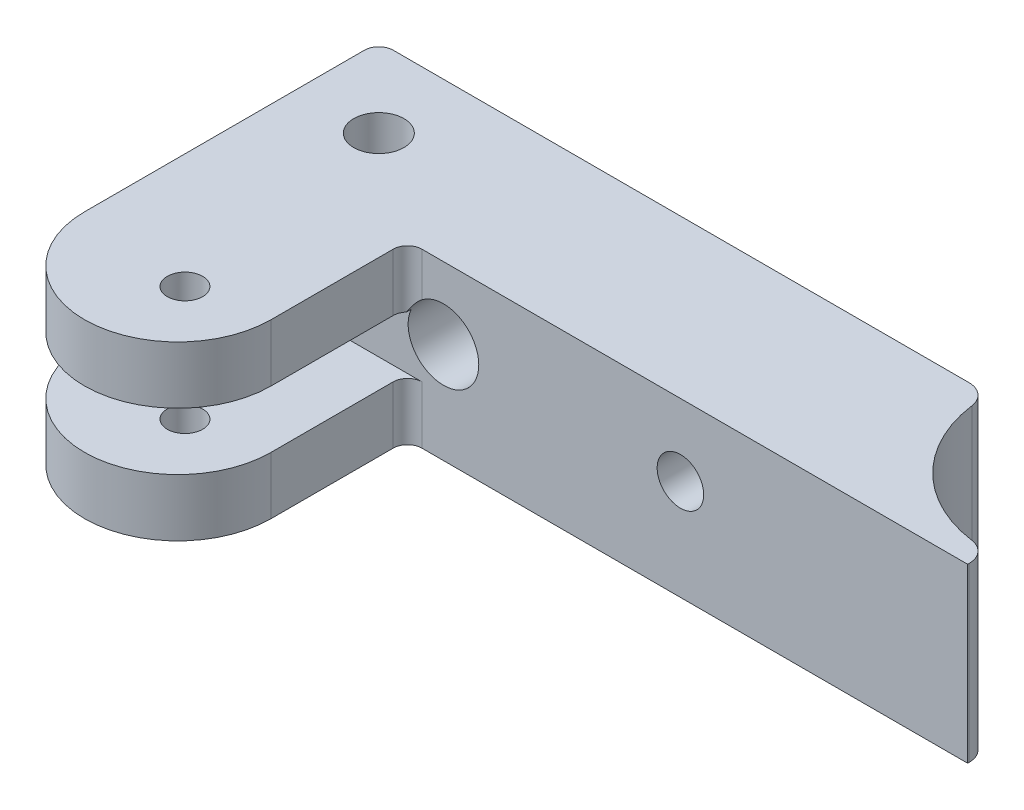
ISO-10303-21;
HEADER;
FILE_DESCRIPTION(('STEP AP214'),'2;1');
FILE_NAME('part.step','',(''),(''),'','','');
FILE_SCHEMA(('AUTOMOTIVE_DESIGN { 1 0 10303 214 1 1 1 1 }'));
ENDSEC;
DATA;
#1=APPLICATION_CONTEXT('core data for automotive mechanical design processes');
#2=APPLICATION_PROTOCOL_DEFINITION('international standard','automotive_design',2000,#1);
#3=PRODUCT_CONTEXT('',#1,'mechanical');
#4=PRODUCT('Part','Part','',(#3));
#5=PRODUCT_RELATED_PRODUCT_CATEGORY('part','',(#4));
#6=PRODUCT_DEFINITION_FORMATION('','',#4);
#7=PRODUCT_DEFINITION_CONTEXT('part definition',#1,'design');
#8=PRODUCT_DEFINITION('design','',#6,#7);
#9=PRODUCT_DEFINITION_SHAPE('','',#8);
#10=(LENGTH_UNIT() NAMED_UNIT(*) SI_UNIT(.MILLI.,.METRE.));
#11=(NAMED_UNIT(*) PLANE_ANGLE_UNIT() SI_UNIT($,.RADIAN.));
#12=(NAMED_UNIT(*) SI_UNIT($,.STERADIAN.) SOLID_ANGLE_UNIT());
#13=UNCERTAINTY_MEASURE_WITH_UNIT(LENGTH_MEASURE(1.E-05),#10,'distance_accuracy_value','');
#14=(GEOMETRIC_REPRESENTATION_CONTEXT(3) GLOBAL_UNCERTAINTY_ASSIGNED_CONTEXT((#13)) GLOBAL_UNIT_ASSIGNED_CONTEXT((#10,
#11,#12)) REPRESENTATION_CONTEXT('',''));
#15=CARTESIAN_POINT('',(0.,0.,0.));
#16=DIRECTION('',(0.,0.,1.));
#17=DIRECTION('',(1.,0.,0.));
#18=AXIS2_PLACEMENT_3D('',#15,#16,#17);
#19=CARTESIAN_POINT('',(0.,0.,27.));
#20=DIRECTION('',(0.,0.,-1.));
#21=DIRECTION('',(1.,0.,0.));
#22=AXIS2_PLACEMENT_3D('',#19,#20,#21);
#23=PLANE('',#22);
#24=CARTESIAN_POINT('',(15.5,7.,27.));
#25=DIRECTION('',(0.,0.,-1.));
#26=DIRECTION('',(1.,0.,0.));
#27=AXIS2_PLACEMENT_3D('',#24,#25,#26);
#28=CIRCLE('',#27,2.4585);
#29=CARTESIAN_POINT('',(17.9585,7.,27.));
#30=VERTEX_POINT('',#29);
#31=EDGE_CURVE('E280',#30,#30,#28,.T.);
#32=ORIENTED_EDGE('',*,*,#31,.F.);
#33=EDGE_LOOP('',(#32));
#34=FACE_BOUND('',#33,.T.);
#35=CARTESIAN_POINT('',(32.,7.,27.));
#36=DIRECTION('',(0.,0.,-1.));
#37=DIRECTION('',(1.,0.,0.));
#38=AXIS2_PLACEMENT_3D('',#35,#36,#37);
#39=CIRCLE('',#38,1.621);
#40=CARTESIAN_POINT('',(33.621,7.,27.));
#41=VERTEX_POINT('',#40);
#42=EDGE_CURVE('E282',#41,#41,#39,.T.);
#43=ORIENTED_EDGE('',*,*,#42,.F.);
#44=EDGE_LOOP('',(#43));
#45=FACE_BOUND('',#44,.T.);
#46=DIRECTION('',(0.,1.,0.));
#47=VECTOR('',#46,1.);
#48=CARTESIAN_POINT('',(1.,0.,27.));
#49=LINE('',#48,#47);
#50=CARTESIAN_POINT('',(1.,0.,27.));
#51=VERTEX_POINT('',#50);
#52=CARTESIAN_POINT('',(1.,12.,27.));
#53=VERTEX_POINT('',#52);
#54=EDGE_CURVE('E192',#51,#53,#49,.T.);
#55=ORIENTED_EDGE('',*,*,#54,.T.);
#56=DIRECTION('',(1.,0.,0.));
#57=VECTOR('',#56,1.);
#58=CARTESIAN_POINT('',(0.,12.,27.));
#59=LINE('',#58,#57);
#60=CARTESIAN_POINT('',(41.1027526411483,12.,27.));
#61=VERTEX_POINT('',#60);
#62=EDGE_CURVE('E217',#53,#61,#59,.T.);
#63=ORIENTED_EDGE('',*,*,#62,.T.);
#64=DIRECTION('',(0.,-1.,0.));
#65=VECTOR('',#64,1.);
#66=CARTESIAN_POINT('',(41.1027526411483,59.8080262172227,27.));
#67=LINE('',#66,#65);
#68=CARTESIAN_POINT('',(41.1027526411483,0.,27.));
#69=VERTEX_POINT('',#68);
#70=EDGE_CURVE('E199',#61,#69,#67,.T.);
#71=ORIENTED_EDGE('',*,*,#70,.T.);
#72=DIRECTION('',(1.,0.,0.));
#73=VECTOR('',#72,1.);
#74=CARTESIAN_POINT('',(0.,0.,27.));
#75=LINE('',#74,#73);
#76=EDGE_CURVE('E185',#51,#69,#75,.T.);
#77=ORIENTED_EDGE('',*,*,#76,.F.);
#78=EDGE_LOOP('',(#55,#63,#71,#77));
#79=FACE_BOUND('',#78,.T.);
#80=ADVANCED_FACE('F40',(#34,#45,#79),#23,.T.);
#81=CARTESIAN_POINT('',(5.5,59.8080262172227,32.5));
#82=DIRECTION('',(0.,1.,0.));
#83=DIRECTION('',(1.,0.,0.));
#84=AXIS2_PLACEMENT_3D('',#81,#82,#83);
#85=CYLINDRICAL_SURFACE('',#84,1.75);
#86=CARTESIAN_POINT('',(5.5,6.5,32.5));
#87=DIRECTION('',(0.,1.,0.));
#88=DIRECTION('',(1.,0.,0.));
#89=AXIS2_PLACEMENT_3D('',#86,#87,#88);
#90=CIRCLE('',#89,1.75);
#91=CARTESIAN_POINT('',(3.75,6.5,32.5));
#92=VERTEX_POINT('',#91);
#93=EDGE_CURVE('E11',#92,#92,#90,.T.);
#94=ORIENTED_EDGE('',*,*,#93,.F.);
#95=EDGE_LOOP('',(#94));
#96=FACE_BOUND('',#95,.T.);
#97=CARTESIAN_POINT('',(5.5,12.,32.5));
#98=DIRECTION('',(0.,1.,0.));
#99=DIRECTION('',(1.,0.,0.));
#100=AXIS2_PLACEMENT_3D('',#97,#98,#99);
#101=CIRCLE('',#100,1.75);
#102=CARTESIAN_POINT('',(3.75,12.,32.5));
#103=VERTEX_POINT('',#102);
#104=EDGE_CURVE('E327',#103,#103,#101,.T.);
#105=ORIENTED_EDGE('',*,*,#104,.T.);
#106=EDGE_LOOP('',(#105));
#107=FACE_BOUND('',#106,.T.);
#108=ADVANCED_FACE('F395',(#96,#107),#85,.F.);
#109=CARTESIAN_POINT('',(5.5,3.25,32.5));
#110=DIRECTION('',(0.,1.,0.));
#111=DIRECTION('',(1.,0.,0.));
#112=AXIS2_PLACEMENT_3D('',#109,#110,#111);
#113=CYLINDRICAL_SURFACE('',#112,4.);
#114=CARTESIAN_POINT('',(5.5,6.5,32.5));
#115=DIRECTION('',(0.,1.,0.));
#116=DIRECTION('',(1.,0.,0.));
#117=AXIS2_PLACEMENT_3D('',#114,#115,#116);
#118=CIRCLE('',#117,4.);
#119=CARTESIAN_POINT('',(9.5,6.5,32.5));
#120=VERTEX_POINT('',#119);
#121=EDGE_CURVE('E52',#120,#120,#118,.T.);
#122=ORIENTED_EDGE('',*,*,#121,.T.);
#123=EDGE_LOOP('',(#122));
#124=FACE_BOUND('',#123,.T.);
#125=CARTESIAN_POINT('',(5.5,0.,32.5));
#126=DIRECTION('',(0.,-1.,0.));
#127=DIRECTION('',(1.,0.,0.));
#128=AXIS2_PLACEMENT_3D('',#125,#126,#127);
#129=CIRCLE('',#128,4.);
#130=CARTESIAN_POINT('',(9.5,0.,32.5));
#131=VERTEX_POINT('',#130);
#132=EDGE_CURVE('E247',#131,#131,#129,.T.);
#133=ORIENTED_EDGE('',*,*,#132,.T.);
#134=EDGE_LOOP('',(#133));
#135=FACE_BOUND('',#134,.T.);
#136=ADVANCED_FACE('F387',(#124,#135),#113,.F.);
#137=CARTESIAN_POINT('',(5.5,6.5,32.5));
#138=DIRECTION('',(0.,-1.,0.));
#139=DIRECTION('',(1.,0.,0.));
#140=AXIS2_PLACEMENT_3D('',#137,#138,#139);
#141=PLANE('',#140);
#142=ORIENTED_EDGE('',*,*,#93,.T.);
#143=EDGE_LOOP('',(#142));
#144=FACE_BOUND('',#143,.T.);
#145=ORIENTED_EDGE('',*,*,#121,.F.);
#146=EDGE_LOOP('',(#145));
#147=FACE_BOUND('',#146,.T.);
#148=ADVANCED_FACE('F383',(#144,#147),#141,.T.);
#149=CARTESIAN_POINT('',(8.,-47.8080262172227,48.5));
#150=DIRECTION('',(0.,-1.,0.));
#151=DIRECTION('',(1.,0.,0.));
#152=AXIS2_PLACEMENT_3D('',#149,#150,#151);
#153=CYLINDRICAL_SURFACE('',#152,1.2295);
#154=CARTESIAN_POINT('',(8.,12.,48.5));
#155=DIRECTION('',(0.,1.,0.));
#156=DIRECTION('',(1.,0.,0.));
#157=AXIS2_PLACEMENT_3D('',#154,#155,#156);
#158=CIRCLE('',#157,1.2295);
#159=CARTESIAN_POINT('',(9.2295,12.,48.5));
#160=VERTEX_POINT('',#159);
#161=EDGE_CURVE('E323',#160,#160,#158,.T.);
#162=ORIENTED_EDGE('',*,*,#161,.T.);
#163=EDGE_LOOP('',(#162));
#164=FACE_BOUND('',#163,.T.);
#165=CARTESIAN_POINT('',(8.,8.,48.5));
#166=DIRECTION('',(0.,1.,0.));
#167=DIRECTION('',(1.,0.,0.));
#168=AXIS2_PLACEMENT_3D('',#165,#166,#167);
#169=CIRCLE('',#168,1.2295);
#170=CARTESIAN_POINT('',(6.7705,8.,48.5));
#171=VERTEX_POINT('',#170);
#172=EDGE_CURVE('E331',#171,#171,#169,.T.);
#173=ORIENTED_EDGE('',*,*,#172,.F.);
#174=EDGE_LOOP('',(#173));
#175=FACE_BOUND('',#174,.T.);
#176=ADVANCED_FACE('F379',(#164,#175),#153,.F.);
#177=CARTESIAN_POINT('',(8.,-47.8080262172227,48.5));
#178=DIRECTION('',(0.,-1.,0.));
#179=DIRECTION('',(1.,0.,0.));
#180=AXIS2_PLACEMENT_3D('',#177,#178,#179);
#181=CYLINDRICAL_SURFACE('',#180,1.2295);
#182=CARTESIAN_POINT('',(8.,4.,48.5));
#183=DIRECTION('',(0.,-1.,0.));
#184=DIRECTION('',(1.,0.,0.));
#185=AXIS2_PLACEMENT_3D('',#182,#183,#184);
#186=CIRCLE('',#185,1.2295);
#187=CARTESIAN_POINT('',(6.7705,4.,48.5));
#188=VERTEX_POINT('',#187);
#189=EDGE_CURVE('E307',#188,#188,#186,.T.);
#190=ORIENTED_EDGE('',*,*,#189,.F.);
#191=EDGE_LOOP('',(#190));
#192=FACE_BOUND('',#191,.T.);
#193=CARTESIAN_POINT('',(8.,0.,48.5));
#194=DIRECTION('',(0.,-1.,0.));
#195=DIRECTION('',(1.,0.,0.));
#196=AXIS2_PLACEMENT_3D('',#193,#194,#195);
#197=CIRCLE('',#196,1.2295);
#198=CARTESIAN_POINT('',(6.7705,0.,48.5));
#199=VERTEX_POINT('',#198);
#200=EDGE_CURVE('E201',#199,#199,#197,.T.);
#201=ORIENTED_EDGE('',*,*,#200,.T.);
#202=EDGE_LOOP('',(#201));
#203=FACE_BOUND('',#202,.T.);
#204=ADVANCED_FACE('F382',(#192,#203),#181,.F.);
#205=CARTESIAN_POINT('',(15.5,7.,86.8080262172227));
#206=DIRECTION('',(0.,0.,1.));
#207=DIRECTION('',(1.,0.,0.));
#208=AXIS2_PLACEMENT_3D('',#205,#206,#207);
#209=CYLINDRICAL_SURFACE('',#208,2.4585);
#210=ORIENTED_EDGE('',*,*,#31,.T.);
#211=EDGE_LOOP('',(#210));
#212=FACE_BOUND('',#211,.T.);
#213=CARTESIAN_POINT('',(15.5,7.,38.));
#214=DIRECTION('',(0.,0.,1.));
#215=DIRECTION('',(1.,0.,0.));
#216=AXIS2_PLACEMENT_3D('',#213,#214,#215);
#217=CIRCLE('',#216,2.4585);
#218=CARTESIAN_POINT('',(13.2540653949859,8.,38.));
#219=VERTEX_POINT('',#218);
#220=CARTESIAN_POINT('',(14.,8.94787634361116,38.));
#221=VERTEX_POINT('',#220);
#222=EDGE_CURVE('E234',#219,#221,#217,.T.);
#223=ORIENTED_EDGE('',*,*,#222,.T.);
#224=CARTESIAN_POINT('',(14.0000001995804,8.94787649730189,37.9993376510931));
#225=CARTESIAN_POINT('',(13.9810851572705,8.93331175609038,37.9993298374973));
#226=CARTESIAN_POINT('',(13.9623864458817,8.91847249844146,37.9998743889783));
#227=CARTESIAN_POINT('',(13.924939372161,8.88785760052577,38.0020133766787));
#228=CARTESIAN_POINT('',(13.9062046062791,8.87206734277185,38.0036371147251));
#229=CARTESIAN_POINT('',(13.8687383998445,8.83952219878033,38.0079331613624));
#230=CARTESIAN_POINT('',(13.8500231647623,8.82275260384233,38.01063482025));
#231=CARTESIAN_POINT('',(13.8126489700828,8.78822126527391,38.0170869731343));
#232=CARTESIAN_POINT('',(13.7940086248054,8.77044485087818,38.020866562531));
#233=CARTESIAN_POINT('',(13.7568413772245,8.73387447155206,38.0294751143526));
#234=CARTESIAN_POINT('',(13.738335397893,8.71506601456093,38.0343326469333));
#235=CARTESIAN_POINT('',(13.7014968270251,8.67640786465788,38.0450967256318));
#236=CARTESIAN_POINT('',(13.6831873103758,8.65654396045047,38.0510310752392));
#237=CARTESIAN_POINT('',(13.6468059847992,8.61575500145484,38.0639534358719));
#238=CARTESIAN_POINT('',(13.6287592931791,8.59481615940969,38.0709684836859));
#239=CARTESIAN_POINT('',(13.5929672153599,8.55185496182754,38.0860380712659));
#240=CARTESIAN_POINT('',(13.5752487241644,8.5298191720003,38.094118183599));
#241=CARTESIAN_POINT('',(13.5447664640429,8.49055333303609,38.1091271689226));
#242=CARTESIAN_POINT('',(13.5318127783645,8.47340416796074,38.1158835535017));
#243=CARTESIAN_POINT('',(13.5058082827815,8.43802903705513,38.1302066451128));
#244=CARTESIAN_POINT('',(13.492785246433,8.41979223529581,38.1377970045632));
#245=CARTESIAN_POINT('',(13.4667099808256,8.38220907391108,38.1537782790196));
#246=CARTESIAN_POINT('',(13.4536866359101,8.36285162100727,38.1621901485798));
#247=CARTESIAN_POINT('',(13.4276858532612,8.32299975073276,38.1798198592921));
#248=CARTESIAN_POINT('',(13.4147385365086,8.3024942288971,38.1890569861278));
#249=CARTESIAN_POINT('',(13.388968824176,8.2603202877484,38.2083379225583));
#250=CARTESIAN_POINT('',(13.3761777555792,8.23864079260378,38.2183993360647));
#251=CARTESIAN_POINT('',(13.3508044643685,8.19409618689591,38.2393307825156));
#252=CARTESIAN_POINT('',(13.338254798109,8.17122014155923,38.2502169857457));
#253=CARTESIAN_POINT('',(13.3134527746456,8.12426306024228,38.272798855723));
#254=CARTESIAN_POINT('',(13.3012342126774,8.10017133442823,38.2845093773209));
#255=CARTESIAN_POINT('',(13.2771878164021,8.0507676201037,38.3087428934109));
#256=CARTESIAN_POINT('',(13.2653950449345,8.02544530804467,38.3212796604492));
#257=CARTESIAN_POINT('',(13.2540643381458,7.99999762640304,38.3339751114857));
#258=B_SPLINE_CURVE_WITH_KNOTS('',3,(#224,#225,#226,#227,#228,#229,#230,#231,#232,#233,#234,
#235,#236,#237,#238,#239,#240,#241,#242,#243,#244,#245,#246,#247,#248,#249,#250,#251,#252,#253,
#254,#255,#256,#257),.UNSPECIFIED.,.F.,.F.,(4,2,2,2,2,2,2,2,2,2,2,2,2,2,2,2,4),(0.,
0.0716035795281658,0.145235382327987,0.221026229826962,0.299096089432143,0.379554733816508,
0.46250245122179,0.54803077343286,0.636223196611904,0.703797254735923,0.774763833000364,
0.849153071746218,0.92699113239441,1.00830084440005,1.0931022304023,1.18141293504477,
1.27324857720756),.UNSPECIFIED.);
#259=CARTESIAN_POINT('',(13.2540653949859,8.,38.3339808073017));
#260=VERTEX_POINT('',#259);
#261=EDGE_CURVE('E348',#221,#260,#258,.T.);
#262=ORIENTED_EDGE('',*,*,#261,.T.);
#263=DIRECTION('',(0.,0.,-1.));
#264=VECTOR('',#263,1.);
#265=CARTESIAN_POINT('',(13.2540653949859,8.,86.8080262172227));
#266=LINE('',#265,#264);
#267=EDGE_CURVE('E270',#260,#219,#266,.T.);
#268=ORIENTED_EDGE('',*,*,#267,.T.);
#269=EDGE_LOOP('',(#223,#262,#268));
#270=FACE_BOUND('',#269,.T.);
#271=ADVANCED_FACE('F402',(#212,#270),#209,.F.);
#272=CARTESIAN_POINT('',(32.,7.,86.8080262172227));
#273=DIRECTION('',(0.,0.,1.));
#274=DIRECTION('',(1.,0.,0.));
#275=AXIS2_PLACEMENT_3D('',#272,#273,#274);
#276=CYLINDRICAL_SURFACE('',#275,1.621);
#277=ORIENTED_EDGE('',*,*,#42,.T.);
#278=EDGE_LOOP('',(#277));
#279=FACE_BOUND('',#278,.T.);
#280=CARTESIAN_POINT('',(32.,7.,38.));
#281=DIRECTION('',(0.,0.,1.));
#282=DIRECTION('',(1.,0.,0.));
#283=AXIS2_PLACEMENT_3D('',#280,#281,#282);
#284=CIRCLE('',#283,1.621);
#285=CARTESIAN_POINT('',(30.379,7.,38.));
#286=VERTEX_POINT('',#285);
#287=EDGE_CURVE('E231',#286,#286,#284,.T.);
#288=ORIENTED_EDGE('',*,*,#287,.T.);
#289=EDGE_LOOP('',(#288));
#290=FACE_BOUND('',#289,.T.);
#291=ADVANCED_FACE('F407',(#279,#290),#276,.F.);
#292=CARTESIAN_POINT('',(52.,0.,27.));
#293=DIRECTION('',(1.,0.,0.));
#294=DIRECTION('',(0.,0.,1.));
#295=AXIS2_PLACEMENT_3D('',#292,#293,#294);
#296=PLANE('',#295);
#297=DIRECTION('',(0.,1.,0.));
#298=VECTOR('',#297,1.);
#299=CARTESIAN_POINT('',(52.,59.8080262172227,37.8972473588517));
#300=LINE('',#299,#298);
#301=CARTESIAN_POINT('',(52.,0.,37.8972473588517));
#302=VERTEX_POINT('',#301);
#303=CARTESIAN_POINT('',(52.,12.,37.8972473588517));
#304=VERTEX_POINT('',#303);
#305=EDGE_CURVE('E224',#302,#304,#300,.T.);
#306=ORIENTED_EDGE('',*,*,#305,.T.);
#307=DIRECTION('',(0.,0.,1.));
#308=VECTOR('',#307,1.);
#309=CARTESIAN_POINT('',(52.,12.,27.));
#310=LINE('',#309,#308);
#311=CARTESIAN_POINT('',(52.,12.,38.));
#312=VERTEX_POINT('',#311);
#313=EDGE_CURVE('E279',#304,#312,#310,.T.);
#314=ORIENTED_EDGE('',*,*,#313,.T.);
#315=DIRECTION('',(0.,1.,0.));
#316=VECTOR('',#315,1.);
#317=CARTESIAN_POINT('',(52.,0.,38.));
#318=LINE('',#317,#316);
#319=CARTESIAN_POINT('',(52.,0.,38.));
#320=VERTEX_POINT('',#319);
#321=EDGE_CURVE('E296',#320,#312,#318,.T.);
#322=ORIENTED_EDGE('',*,*,#321,.F.);
#323=DIRECTION('',(0.,0.,1.));
#324=VECTOR('',#323,1.);
#325=CARTESIAN_POINT('',(52.,0.,27.));
#326=LINE('',#325,#324);
#327=EDGE_CURVE('E239',#302,#320,#326,.T.);
#328=ORIENTED_EDGE('',*,*,#327,.F.);
#329=EDGE_LOOP('',(#306,#314,#322,#328));
#330=FACE_BOUND('',#329,.T.);
#331=ADVANCED_FACE('F437',(#330),#296,.T.);
#332=CARTESIAN_POINT('',(41.1027526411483,59.8080262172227,28.5));
#333=DIRECTION('',(0.,-1.,0.));
#334=DIRECTION('',(0.657128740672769,0.,-0.753778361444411));
#335=AXIS2_PLACEMENT_3D('',#332,#333,#334);
#336=CYLINDRICAL_SURFACE('',#335,1.5);
#337=CARTESIAN_POINT('',(41.1027526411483,12.,28.5));
#338=DIRECTION('',(0.,1.,0.));
#339=DIRECTION('',(0.657128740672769,0.,-0.753778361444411));
#340=AXIS2_PLACEMENT_3D('',#337,#338,#339);
#341=CIRCLE('',#340,1.5);
#342=CARTESIAN_POINT('',(42.5887409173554,12.,28.2954545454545));
#343=VERTEX_POINT('',#342);
#344=EDGE_CURVE('E248',#343,#61,#341,.T.);
#345=ORIENTED_EDGE('',*,*,#344,.F.);
#346=DIRECTION('',(0.,1.,0.));
#347=VECTOR('',#346,1.);
#348=CARTESIAN_POINT('',(42.5887409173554,59.8080262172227,28.2954545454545));
#349=LINE('',#348,#347);
#350=CARTESIAN_POINT('',(42.5887409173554,0.,28.2954545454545));
#351=VERTEX_POINT('',#350);
#352=EDGE_CURVE('E223',#351,#343,#349,.T.);
#353=ORIENTED_EDGE('',*,*,#352,.F.);
#354=CARTESIAN_POINT('',(41.1027526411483,0.,28.5));
#355=DIRECTION('',(0.,-1.,0.));
#356=DIRECTION('',(0.657128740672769,0.,-0.753778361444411));
#357=AXIS2_PLACEMENT_3D('',#354,#355,#356);
#358=CIRCLE('',#357,1.5);
#359=EDGE_CURVE('E202',#69,#351,#358,.T.);
#360=ORIENTED_EDGE('',*,*,#359,.F.);
#361=ORIENTED_EDGE('',*,*,#70,.F.);
#362=EDGE_LOOP('',(#345,#353,#360,#361));
#363=FACE_BOUND('',#362,.T.);
#364=ADVANCED_FACE('F440',(#363),#336,.T.);
#365=CARTESIAN_POINT('',(52.,59.8080262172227,27.));
#366=DIRECTION('',(0.,1.,0.));
#367=DIRECTION('',(1.,0.,0.));
#368=AXIS2_PLACEMENT_3D('',#365,#366,#367);
#369=CYLINDRICAL_SURFACE('',#368,9.5);
#370=DIRECTION('',(0.,-1.,0.));
#371=VECTOR('',#370,1.);
#372=CARTESIAN_POINT('',(50.7045454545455,59.8080262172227,36.4112590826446));
#373=LINE('',#372,#371);
#374=CARTESIAN_POINT('',(50.7045454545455,12.,36.4112590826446));
#375=VERTEX_POINT('',#374);
#376=CARTESIAN_POINT('',(50.7045454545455,0.,36.4112590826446));
#377=VERTEX_POINT('',#376);
#378=EDGE_CURVE('E219',#375,#377,#373,.T.);
#379=ORIENTED_EDGE('',*,*,#378,.T.);
#380=CARTESIAN_POINT('',(52.,0.,27.));
#381=DIRECTION('',(0.,-1.,0.));
#382=DIRECTION('',(1.,0.,0.));
#383=AXIS2_PLACEMENT_3D('',#380,#381,#382);
#384=CIRCLE('',#383,9.5);
#385=EDGE_CURVE('E238',#377,#351,#384,.T.);
#386=ORIENTED_EDGE('',*,*,#385,.T.);
#387=ORIENTED_EDGE('',*,*,#352,.T.);
#388=CARTESIAN_POINT('',(52.,12.,27.));
#389=DIRECTION('',(0.,1.,0.));
#390=DIRECTION('',(1.,0.,0.));
#391=AXIS2_PLACEMENT_3D('',#388,#389,#390);
#392=CIRCLE('',#391,9.5);
#393=EDGE_CURVE('E251',#343,#375,#392,.T.);
#394=ORIENTED_EDGE('',*,*,#393,.T.);
#395=EDGE_LOOP('',(#379,#386,#387,#394));
#396=FACE_BOUND('',#395,.T.);
#397=ADVANCED_FACE('F42',(#396),#369,.F.);
#398=CARTESIAN_POINT('',(50.5,59.8080262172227,37.8972473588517));
#399=DIRECTION('',(0.,1.,0.));
#400=DIRECTION('',(0.753778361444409,0.,-0.657128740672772));
#401=AXIS2_PLACEMENT_3D('',#398,#399,#400);
#402=CYLINDRICAL_SURFACE('',#401,1.5);
#403=CARTESIAN_POINT('',(50.5,0.,37.8972473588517));
#404=DIRECTION('',(0.,-1.,0.));
#405=DIRECTION('',(0.753778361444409,0.,-0.657128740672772));
#406=AXIS2_PLACEMENT_3D('',#403,#404,#405);
#407=CIRCLE('',#406,1.5);
#408=EDGE_CURVE('E235',#377,#302,#407,.T.);
#409=ORIENTED_EDGE('',*,*,#408,.F.);
#410=ORIENTED_EDGE('',*,*,#378,.F.);
#411=CARTESIAN_POINT('',(50.5,12.,37.8972473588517));
#412=DIRECTION('',(0.,1.,0.));
#413=DIRECTION('',(0.753778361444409,0.,-0.657128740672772));
#414=AXIS2_PLACEMENT_3D('',#411,#412,#413);
#415=CIRCLE('',#414,1.5);
#416=EDGE_CURVE('E144',#304,#375,#415,.T.);
#417=ORIENTED_EDGE('',*,*,#416,.F.);
#418=ORIENTED_EDGE('',*,*,#305,.F.);
#419=EDGE_LOOP('',(#409,#410,#417,#418));
#420=FACE_BOUND('',#419,.T.);
#421=ADVANCED_FACE('F429',(#420),#402,.T.);
#422=CARTESIAN_POINT('',(13.,4.,54.));
#423=DIRECTION('',(0.,-1.,0.));
#424=DIRECTION('',(0.,0.,-1.));
#425=AXIS2_PLACEMENT_3D('',#422,#423,#424);
#426=PLANE('',#425);
#427=ORIENTED_EDGE('',*,*,#189,.T.);
#428=EDGE_LOOP('',(#427));
#429=FACE_BOUND('',#428,.T.);
#430=CARTESIAN_POINT('',(6.5,4.,47.5));
#431=DIRECTION('',(0.,1.,0.));
#432=DIRECTION('',(0.707106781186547,0.,0.707106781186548));
#433=AXIS2_PLACEMENT_3D('',#430,#431,#432);
#434=CIRCLE('',#433,6.5);
#435=CARTESIAN_POINT('',(0.,4.,47.5));
#436=VERTEX_POINT('',#435);
#437=CARTESIAN_POINT('',(13.,4.,47.5));
#438=VERTEX_POINT('',#437);
#439=EDGE_CURVE('E316',#436,#438,#434,.T.);
#440=ORIENTED_EDGE('',*,*,#439,.T.);
#441=DIRECTION('',(0.,0.,-1.));
#442=VECTOR('',#441,1.);
#443=CARTESIAN_POINT('',(13.,4.,46.));
#444=LINE('',#443,#442);
#445=CARTESIAN_POINT('',(13.,4.,39.));
#446=VERTEX_POINT('',#445);
#447=EDGE_CURVE('E315',#438,#446,#444,.T.);
#448=ORIENTED_EDGE('',*,*,#447,.T.);
#449=CARTESIAN_POINT('',(14.,4.,39.));
#450=DIRECTION('',(0.,-1.,0.));
#451=DIRECTION('',(-0.707106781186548,0.,-0.707106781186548));
#452=AXIS2_PLACEMENT_3D('',#449,#450,#451);
#453=CIRCLE('',#452,1.);
#454=CARTESIAN_POINT('',(14.,4.,38.));
#455=VERTEX_POINT('',#454);
#456=EDGE_CURVE('E229',#446,#455,#453,.T.);
#457=ORIENTED_EDGE('',*,*,#456,.T.);
#458=DIRECTION('',(-1.,0.,0.));
#459=VECTOR('',#458,1.);
#460=CARTESIAN_POINT('',(13.,4.,38.));
#461=LINE('',#460,#459);
#462=CARTESIAN_POINT('',(0.,4.,38.));
#463=VERTEX_POINT('',#462);
#464=EDGE_CURVE('E260',#455,#463,#461,.T.);
#465=ORIENTED_EDGE('',*,*,#464,.T.);
#466=DIRECTION('',(0.,0.,1.));
#467=VECTOR('',#466,1.);
#468=CARTESIAN_POINT('',(0.,4.,54.));
#469=LINE('',#468,#467);
#470=EDGE_CURVE('E252',#463,#436,#469,.T.);
#471=ORIENTED_EDGE('',*,*,#470,.T.);
#472=EDGE_LOOP('',(#440,#448,#457,#465,#471));
#473=FACE_BOUND('',#472,.T.);
#474=ADVANCED_FACE('F432',(#429,#473),#426,.F.);
#475=CARTESIAN_POINT('',(13.,0.,38.));
#476=DIRECTION('',(1.,0.,0.));
#477=DIRECTION('',(0.,0.,1.));
#478=AXIS2_PLACEMENT_3D('',#475,#476,#477);
#479=PLANE('',#478);
#480=DIRECTION('',(0.,1.,0.));
#481=VECTOR('',#480,1.);
#482=CARTESIAN_POINT('',(13.,0.,39.));
#483=LINE('',#482,#481);
#484=CARTESIAN_POINT('',(13.,0.,39.));
#485=VERTEX_POINT('',#484);
#486=EDGE_CURVE('E515',#485,#446,#483,.T.);
#487=ORIENTED_EDGE('',*,*,#486,.T.);
#488=ORIENTED_EDGE('',*,*,#447,.F.);
#489=DIRECTION('',(0.,-1.,0.));
#490=VECTOR('',#489,1.);
#491=CARTESIAN_POINT('',(13.,0.,47.5));
#492=LINE('',#491,#490);
#493=CARTESIAN_POINT('',(13.,0.,47.5));
#494=VERTEX_POINT('',#493);
#495=EDGE_CURVE('E311',#438,#494,#492,.T.);
#496=ORIENTED_EDGE('',*,*,#495,.T.);
#497=DIRECTION('',(0.,0.,1.));
#498=VECTOR('',#497,1.);
#499=CARTESIAN_POINT('',(13.,0.,38.));
#500=LINE('',#499,#498);
#501=EDGE_CURVE('E242',#485,#494,#500,.T.);
#502=ORIENTED_EDGE('',*,*,#501,.F.);
#503=EDGE_LOOP('',(#487,#488,#496,#502));
#504=FACE_BOUND('',#503,.T.);
#505=ADVANCED_FACE('F433',(#504),#479,.T.);
#506=CARTESIAN_POINT('',(6.5,0.,47.5));
#507=DIRECTION('',(0.,-1.,0.));
#508=DIRECTION('',(0.707106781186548,0.,0.707106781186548));
#509=AXIS2_PLACEMENT_3D('',#506,#507,#508);
#510=CYLINDRICAL_SURFACE('',#509,6.5);
#511=ORIENTED_EDGE('',*,*,#439,.F.);
#512=DIRECTION('',(0.,1.,0.));
#513=VECTOR('',#512,1.);
#514=CARTESIAN_POINT('',(0.,0.,47.5));
#515=LINE('',#514,#513);
#516=CARTESIAN_POINT('',(0.,0.,47.5));
#517=VERTEX_POINT('',#516);
#518=EDGE_CURVE('E256',#517,#436,#515,.T.);
#519=ORIENTED_EDGE('',*,*,#518,.F.);
#520=CARTESIAN_POINT('',(6.5,0.,47.5));
#521=DIRECTION('',(0.,-1.,0.));
#522=DIRECTION('',(-0.707106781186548,0.,0.707106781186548));
#523=AXIS2_PLACEMENT_3D('',#520,#521,#522);
#524=CIRCLE('',#523,6.5);
#525=EDGE_CURVE('E152',#494,#517,#524,.T.);
#526=ORIENTED_EDGE('',*,*,#525,.F.);
#527=ORIENTED_EDGE('',*,*,#495,.F.);
#528=EDGE_LOOP('',(#511,#519,#526,#527));
#529=FACE_BOUND('',#528,.T.);
#530=ADVANCED_FACE('F377',(#529),#510,.T.);
#531=CARTESIAN_POINT('',(6.5,0.,47.5));
#532=DIRECTION('',(0.,-1.,0.));
#533=DIRECTION('',(0.707106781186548,0.,0.707106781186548));
#534=AXIS2_PLACEMENT_3D('',#531,#532,#533);
#535=CYLINDRICAL_SURFACE('',#534,6.5);
#536=CARTESIAN_POINT('',(6.5,12.,47.5));
#537=DIRECTION('',(0.,1.,0.));
#538=DIRECTION('',(-0.707106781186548,0.,0.707106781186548));
#539=AXIS2_PLACEMENT_3D('',#536,#537,#538);
#540=CIRCLE('',#539,6.5);
#541=CARTESIAN_POINT('',(0.,12.,47.5));
#542=VERTEX_POINT('',#541);
#543=CARTESIAN_POINT('',(13.,12.,47.5));
#544=VERTEX_POINT('',#543);
#545=EDGE_CURVE('E243',#542,#544,#540,.T.);
#546=ORIENTED_EDGE('',*,*,#545,.F.);
#547=DIRECTION('',(0.,1.,0.));
#548=VECTOR('',#547,1.);
#549=CARTESIAN_POINT('',(0.,0.,47.5));
#550=LINE('',#549,#548);
#551=CARTESIAN_POINT('',(0.,8.,47.5));
#552=VERTEX_POINT('',#551);
#553=EDGE_CURVE('E213',#552,#542,#550,.T.);
#554=ORIENTED_EDGE('',*,*,#553,.F.);
#555=CARTESIAN_POINT('',(6.5,8.,47.5));
#556=DIRECTION('',(0.,-1.,0.));
#557=DIRECTION('',(-0.707106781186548,0.,0.707106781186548));
#558=AXIS2_PLACEMENT_3D('',#555,#556,#557);
#559=CIRCLE('',#558,6.5);
#560=CARTESIAN_POINT('',(13.,8.,47.5));
#561=VERTEX_POINT('',#560);
#562=EDGE_CURVE('E266',#561,#552,#559,.T.);
#563=ORIENTED_EDGE('',*,*,#562,.F.);
#564=DIRECTION('',(0.,-1.,0.));
#565=VECTOR('',#564,1.);
#566=CARTESIAN_POINT('',(13.,0.,47.5));
#567=LINE('',#566,#565);
#568=EDGE_CURVE('E230',#544,#561,#567,.T.);
#569=ORIENTED_EDGE('',*,*,#568,.F.);
#570=EDGE_LOOP('',(#546,#554,#563,#569));
#571=FACE_BOUND('',#570,.T.);
#572=ADVANCED_FACE('F373',(#571),#535,.T.);
#573=CARTESIAN_POINT('',(13.,8.,38.));
#574=DIRECTION('',(0.,1.,0.));
#575=DIRECTION('',(0.,0.,1.));
#576=AXIS2_PLACEMENT_3D('',#573,#574,#575);
#577=PLANE('',#576);
#578=ORIENTED_EDGE('',*,*,#172,.T.);
#579=EDGE_LOOP('',(#578));
#580=FACE_BOUND('',#579,.T.);
#581=ORIENTED_EDGE('',*,*,#562,.T.);
#582=DIRECTION('',(0.,0.,-1.));
#583=VECTOR('',#582,1.);
#584=CARTESIAN_POINT('',(0.,8.,46.));
#585=LINE('',#584,#583);
#586=CARTESIAN_POINT('',(0.,8.,38.));
#587=VERTEX_POINT('',#586);
#588=EDGE_CURVE('E257',#552,#587,#585,.T.);
#589=ORIENTED_EDGE('',*,*,#588,.T.);
#590=DIRECTION('',(1.,0.,0.));
#591=VECTOR('',#590,1.);
#592=CARTESIAN_POINT('',(32.5,8.,38.));
#593=LINE('',#592,#591);
#594=EDGE_CURVE('E310',#587,#219,#593,.T.);
#595=ORIENTED_EDGE('',*,*,#594,.T.);
#596=ORIENTED_EDGE('',*,*,#267,.F.);
#597=CARTESIAN_POINT('',(14.,8.,39.));
#598=DIRECTION('',(0.,-1.,0.));
#599=DIRECTION('',(-0.707106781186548,0.,-0.707106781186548));
#600=AXIS2_PLACEMENT_3D('',#597,#598,#599);
#601=CIRCLE('',#600,1.);
#602=CARTESIAN_POINT('',(13.,8.,39.));
#603=VERTEX_POINT('',#602);
#604=EDGE_CURVE('E334',#603,#260,#601,.T.);
#605=ORIENTED_EDGE('',*,*,#604,.F.);
#606=DIRECTION('',(0.,0.,1.));
#607=VECTOR('',#606,1.);
#608=CARTESIAN_POINT('',(13.,8.,38.));
#609=LINE('',#608,#607);
#610=EDGE_CURVE('E303',#603,#561,#609,.T.);
#611=ORIENTED_EDGE('',*,*,#610,.T.);
#612=EDGE_LOOP('',(#581,#589,#595,#596,#605,#611));
#613=FACE_BOUND('',#612,.T.);
#614=ADVANCED_FACE('F376',(#580,#613),#577,.F.);
#615=CARTESIAN_POINT('',(22.0506329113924,0.,36.5506329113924));
#616=DIRECTION('',(0.,1.,0.));
#617=DIRECTION('',(0.,0.,-1.));
#618=AXIS2_PLACEMENT_3D('',#615,#616,#617);
#619=PLANE('',#618);
#620=ORIENTED_EDGE('',*,*,#132,.F.);
#621=EDGE_LOOP('',(#620));
#622=FACE_BOUND('',#621,.T.);
#623=ORIENTED_EDGE('',*,*,#200,.F.);
#624=EDGE_LOOP('',(#623));
#625=FACE_BOUND('',#624,.T.);
#626=CARTESIAN_POINT('',(1.,0.,28.));
#627=DIRECTION('',(0.,-1.,0.));
#628=DIRECTION('',(-0.707106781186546,0.,-0.70710678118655));
#629=AXIS2_PLACEMENT_3D('',#626,#627,#628);
#630=CIRCLE('',#629,1.);
#631=CARTESIAN_POINT('',(0.,0.,28.));
#632=VERTEX_POINT('',#631);
#633=EDGE_CURVE('E181',#632,#51,#630,.T.);
#634=ORIENTED_EDGE('',*,*,#633,.T.);
#635=ORIENTED_EDGE('',*,*,#76,.T.);
#636=ORIENTED_EDGE('',*,*,#359,.T.);
#637=ORIENTED_EDGE('',*,*,#385,.F.);
#638=ORIENTED_EDGE('',*,*,#408,.T.);
#639=ORIENTED_EDGE('',*,*,#327,.T.);
#640=DIRECTION('',(-1.,0.,0.));
#641=VECTOR('',#640,1.);
#642=CARTESIAN_POINT('',(52.,0.,38.));
#643=LINE('',#642,#641);
#644=CARTESIAN_POINT('',(14.,0.,38.));
#645=VERTEX_POINT('',#644);
#646=EDGE_CURVE('E265',#320,#645,#643,.T.);
#647=ORIENTED_EDGE('',*,*,#646,.T.);
#648=CARTESIAN_POINT('',(14.,0.,39.));
#649=DIRECTION('',(0.,1.,0.));
#650=DIRECTION('',(-0.707106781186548,0.,-0.707106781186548));
#651=AXIS2_PLACEMENT_3D('',#648,#649,#650);
#652=CIRCLE('',#651,1.);
#653=EDGE_CURVE('E320',#645,#485,#652,.T.);
#654=ORIENTED_EDGE('',*,*,#653,.T.);
#655=ORIENTED_EDGE('',*,*,#501,.T.);
#656=ORIENTED_EDGE('',*,*,#525,.T.);
#657=DIRECTION('',(0.,0.,-1.));
#658=VECTOR('',#657,1.);
#659=CARTESIAN_POINT('',(0.,0.,54.));
#660=LINE('',#659,#658);
#661=EDGE_CURVE('E188',#517,#632,#660,.T.);
#662=ORIENTED_EDGE('',*,*,#661,.T.);
#663=EDGE_LOOP('',(#634,#635,#636,#637,#638,#639,#647,#654,#655,#656,#662));
#664=FACE_BOUND('',#663,.T.);
#665=ADVANCED_FACE('F183',(#622,#625,#664),#619,.F.);
#666=CARTESIAN_POINT('',(22.0506329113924,12.,36.5506329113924));
#667=DIRECTION('',(0.,1.,0.));
#668=DIRECTION('',(0.,0.,-1.));
#669=AXIS2_PLACEMENT_3D('',#666,#667,#668);
#670=PLANE('',#669);
#671=CARTESIAN_POINT('',(1.,12.,28.));
#672=DIRECTION('',(0.,1.,0.));
#673=DIRECTION('',(-0.707106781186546,0.,-0.70710678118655));
#674=AXIS2_PLACEMENT_3D('',#671,#672,#673);
#675=CIRCLE('',#674,1.);
#676=CARTESIAN_POINT('',(0.,12.,28.));
#677=VERTEX_POINT('',#676);
#678=EDGE_CURVE('E206',#53,#677,#675,.T.);
#679=ORIENTED_EDGE('',*,*,#678,.T.);
#680=DIRECTION('',(0.,0.,-1.));
#681=VECTOR('',#680,1.);
#682=CARTESIAN_POINT('',(0.,12.,54.));
#683=LINE('',#682,#681);
#684=EDGE_CURVE('E209',#542,#677,#683,.T.);
#685=ORIENTED_EDGE('',*,*,#684,.F.);
#686=ORIENTED_EDGE('',*,*,#545,.T.);
#687=DIRECTION('',(0.,0.,1.));
#688=VECTOR('',#687,1.);
#689=CARTESIAN_POINT('',(13.,12.,38.));
#690=LINE('',#689,#688);
#691=CARTESIAN_POINT('',(13.,12.,39.));
#692=VERTEX_POINT('',#691);
#693=EDGE_CURVE('E225',#692,#544,#690,.T.);
#694=ORIENTED_EDGE('',*,*,#693,.F.);
#695=CARTESIAN_POINT('',(14.,12.,39.));
#696=DIRECTION('',(0.,-1.,0.));
#697=DIRECTION('',(-0.707106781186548,0.,-0.707106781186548));
#698=AXIS2_PLACEMENT_3D('',#695,#696,#697);
#699=CIRCLE('',#698,1.);
#700=CARTESIAN_POINT('',(14.,12.,38.));
#701=VERTEX_POINT('',#700);
#702=EDGE_CURVE('E349',#692,#701,#699,.T.);
#703=ORIENTED_EDGE('',*,*,#702,.T.);
#704=DIRECTION('',(-1.,0.,0.));
#705=VECTOR('',#704,1.);
#706=CARTESIAN_POINT('',(52.,12.,38.));
#707=LINE('',#706,#705);
#708=EDGE_CURVE('E460',#312,#701,#707,.T.);
#709=ORIENTED_EDGE('',*,*,#708,.F.);
#710=ORIENTED_EDGE('',*,*,#313,.F.);
#711=ORIENTED_EDGE('',*,*,#416,.T.);
#712=ORIENTED_EDGE('',*,*,#393,.F.);
#713=ORIENTED_EDGE('',*,*,#344,.T.);
#714=ORIENTED_EDGE('',*,*,#62,.F.);
#715=EDGE_LOOP('',(#679,#685,#686,#694,#703,#709,#710,#711,#712,#713,#714));
#716=FACE_BOUND('',#715,.T.);
#717=ORIENTED_EDGE('',*,*,#161,.F.);
#718=EDGE_LOOP('',(#717));
#719=FACE_BOUND('',#718,.T.);
#720=ORIENTED_EDGE('',*,*,#104,.F.);
#721=EDGE_LOOP('',(#720));
#722=FACE_BOUND('',#721,.T.);
#723=ADVANCED_FACE('F391',(#716,#719,#722),#670,.T.);
#724=CARTESIAN_POINT('',(0.,0.,54.));
#725=DIRECTION('',(-1.,0.,0.));
#726=DIRECTION('',(0.,0.,-1.));
#727=AXIS2_PLACEMENT_3D('',#724,#725,#726);
#728=PLANE('',#727);
#729=DIRECTION('',(0.,-1.,0.));
#730=VECTOR('',#729,1.);
#731=CARTESIAN_POINT('',(0.,0.,28.));
#732=LINE('',#731,#730);
#733=EDGE_CURVE('E193',#677,#632,#732,.T.);
#734=ORIENTED_EDGE('',*,*,#733,.T.);
#735=ORIENTED_EDGE('',*,*,#661,.F.);
#736=ORIENTED_EDGE('',*,*,#518,.T.);
#737=ORIENTED_EDGE('',*,*,#470,.F.);
#738=DIRECTION('',(0.,-1.,0.));
#739=VECTOR('',#738,1.);
#740=CARTESIAN_POINT('',(0.,2.,38.));
#741=LINE('',#740,#739);
#742=EDGE_CURVE('E264',#587,#463,#741,.T.);
#743=ORIENTED_EDGE('',*,*,#742,.F.);
#744=ORIENTED_EDGE('',*,*,#588,.F.);
#745=ORIENTED_EDGE('',*,*,#553,.T.);
#746=ORIENTED_EDGE('',*,*,#684,.T.);
#747=EDGE_LOOP('',(#734,#735,#736,#737,#743,#744,#745,#746));
#748=FACE_BOUND('',#747,.T.);
#749=ADVANCED_FACE('F388',(#748),#728,.T.);
#750=CARTESIAN_POINT('',(1.,0.,28.));
#751=DIRECTION('',(0.,-1.,0.));
#752=DIRECTION('',(-0.707106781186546,0.,-0.70710678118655));
#753=AXIS2_PLACEMENT_3D('',#750,#751,#752);
#754=CYLINDRICAL_SURFACE('',#753,1.);
#755=ORIENTED_EDGE('',*,*,#678,.F.);
#756=ORIENTED_EDGE('',*,*,#54,.F.);
#757=ORIENTED_EDGE('',*,*,#633,.F.);
#758=ORIENTED_EDGE('',*,*,#733,.F.);
#759=EDGE_LOOP('',(#755,#756,#757,#758));
#760=FACE_BOUND('',#759,.T.);
#761=ADVANCED_FACE('F204',(#760),#754,.T.);
#762=CARTESIAN_POINT('',(52.,0.,38.));
#763=DIRECTION('',(0.,0.,1.));
#764=DIRECTION('',(-1.,0.,0.));
#765=AXIS2_PLACEMENT_3D('',#762,#763,#764);
#766=PLANE('',#765);
#767=ORIENTED_EDGE('',*,*,#287,.F.);
#768=EDGE_LOOP('',(#767));
#769=FACE_BOUND('',#768,.T.);
#770=DIRECTION('',(0.,-1.,0.));
#771=VECTOR('',#770,1.);
#772=CARTESIAN_POINT('',(14.,0.,38.));
#773=LINE('',#772,#771);
#774=EDGE_CURVE('E345',#701,#221,#773,.T.);
#775=ORIENTED_EDGE('',*,*,#774,.T.);
#776=ORIENTED_EDGE('',*,*,#222,.F.);
#777=ORIENTED_EDGE('',*,*,#594,.F.);
#778=ORIENTED_EDGE('',*,*,#742,.T.);
#779=ORIENTED_EDGE('',*,*,#464,.F.);
#780=DIRECTION('',(0.,-1.,0.));
#781=VECTOR('',#780,1.);
#782=CARTESIAN_POINT('',(14.,0.,38.));
#783=LINE('',#782,#781);
#784=EDGE_CURVE('E317',#455,#645,#783,.T.);
#785=ORIENTED_EDGE('',*,*,#784,.T.);
#786=ORIENTED_EDGE('',*,*,#646,.F.);
#787=ORIENTED_EDGE('',*,*,#321,.T.);
#788=ORIENTED_EDGE('',*,*,#708,.T.);
#789=EDGE_LOOP('',(#775,#776,#777,#778,#779,#785,#786,#787,#788));
#790=FACE_BOUND('',#789,.T.);
#791=ADVANCED_FACE('F452',(#769,#790),#766,.T.);
#792=CARTESIAN_POINT('',(14.,0.,39.));
#793=DIRECTION('',(0.,-1.,0.));
#794=DIRECTION('',(-0.707106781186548,0.,-0.707106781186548));
#795=AXIS2_PLACEMENT_3D('',#792,#793,#794);
#796=CYLINDRICAL_SURFACE('',#795,1.);
#797=ORIENTED_EDGE('',*,*,#456,.F.);
#798=ORIENTED_EDGE('',*,*,#486,.F.);
#799=ORIENTED_EDGE('',*,*,#653,.F.);
#800=ORIENTED_EDGE('',*,*,#784,.F.);
#801=EDGE_LOOP('',(#797,#798,#799,#800));
#802=FACE_BOUND('',#801,.T.);
#803=ADVANCED_FACE('F371',(#802),#796,.F.);
#804=CARTESIAN_POINT('',(13.,0.,38.));
#805=DIRECTION('',(1.,0.,0.));
#806=DIRECTION('',(0.,0.,1.));
#807=AXIS2_PLACEMENT_3D('',#804,#805,#806);
#808=PLANE('',#807);
#809=DIRECTION('',(0.,1.,0.));
#810=VECTOR('',#809,1.);
#811=CARTESIAN_POINT('',(13.,0.,39.));
#812=LINE('',#811,#810);
#813=EDGE_CURVE('E337',#603,#692,#812,.T.);
#814=ORIENTED_EDGE('',*,*,#813,.T.);
#815=ORIENTED_EDGE('',*,*,#693,.T.);
#816=ORIENTED_EDGE('',*,*,#568,.T.);
#817=ORIENTED_EDGE('',*,*,#610,.F.);
#818=EDGE_LOOP('',(#814,#815,#816,#817));
#819=FACE_BOUND('',#818,.T.);
#820=ADVANCED_FACE('F370',(#819),#808,.T.);
#821=CARTESIAN_POINT('',(14.,0.,39.));
#822=DIRECTION('',(0.,-1.,0.));
#823=DIRECTION('',(-0.707106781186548,0.,-0.707106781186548));
#824=AXIS2_PLACEMENT_3D('',#821,#822,#823);
#825=CYLINDRICAL_SURFACE('',#824,1.);
#826=ORIENTED_EDGE('',*,*,#604,.T.);
#827=ORIENTED_EDGE('',*,*,#261,.F.);
#828=ORIENTED_EDGE('',*,*,#774,.F.);
#829=ORIENTED_EDGE('',*,*,#702,.F.);
#830=ORIENTED_EDGE('',*,*,#813,.F.);
#831=EDGE_LOOP('',(#826,#827,#828,#829,#830));
#832=FACE_BOUND('',#831,.T.);
#833=ADVANCED_FACE('F360',(#832),#825,.F.);
#834=CLOSED_SHELL('',(#80,#108,#136,#148,#176,#204,#271,#291,#331,#364,#397,#421,#474,#505,#530,
#572,#614,#665,#723,#749,#761,#791,#803,#820,#833));
#835=MANIFOLD_SOLID_BREP('B2',#834);
#836=ADVANCED_BREP_SHAPE_REPRESENTATION('',(#18,#835),#14);
#837=SHAPE_DEFINITION_REPRESENTATION(#9,#836);
ENDSEC;
END-ISO-10303-21;
